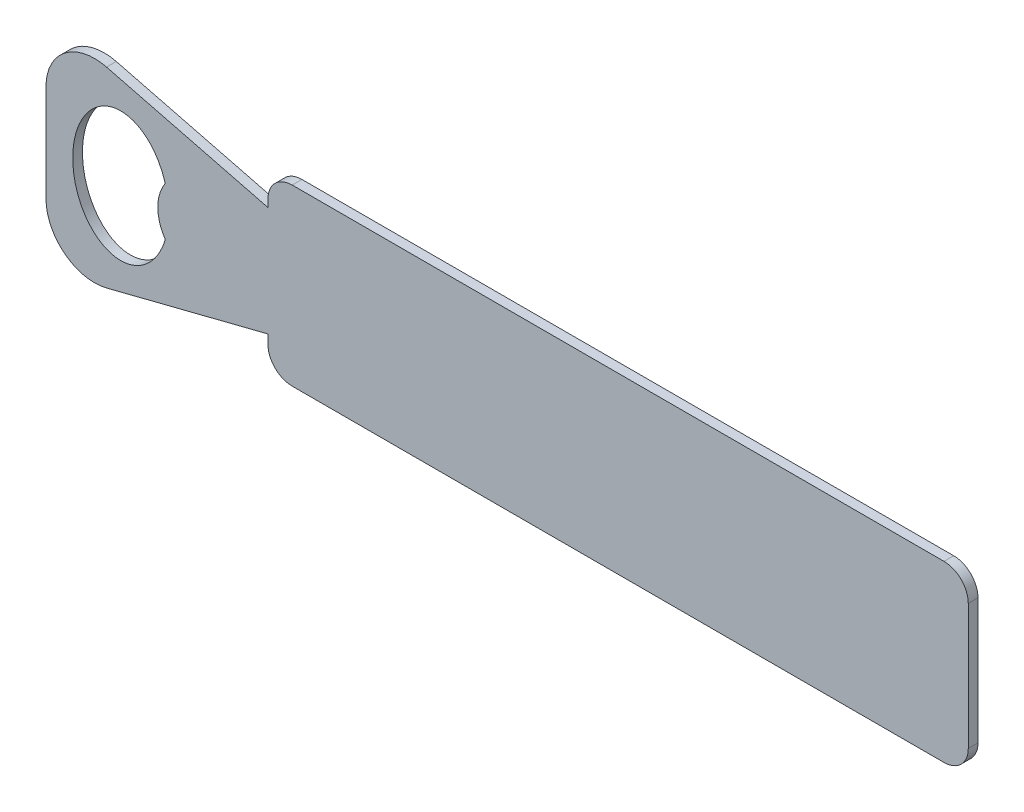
from build123d import *

# Parameters (mm, degrees)
EXTRUDE1_DEPTH     = 2
EXTRUDE2_DEPTH     = 2
SKETCH3_RX         = 13.343908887
SKETCH3_RY         = 9.885073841
CUT_EXTRUDE1_DEPTH = 99.043942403
SKETCH4_R          = 8.854172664
EXTRUDE3_DEPTH     = 2


with BuildPart() as part:
    # Sketch1 → Extrude1 (new body)
    with BuildSketch(Plane.XY):
        with BuildLine():
            Line((-45.254072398, 17.925423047), (88.905159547, 17.925423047))
            ThreePointArc((88.905159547, 17.925423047), (92.440693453, 16.460956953), (93.905159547, 12.925423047))
            Line((93.905159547, 12.925423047), (93.905159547, -12.925423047))
            ThreePointArc((93.905159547, -12.925423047), (92.440693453, -16.460956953), (88.905159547, -17.925423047))
            Line((88.905159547, -17.925423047), (-45.254072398, -17.925423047))
            ThreePointArc((-45.254072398, -17.925423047), (-48.789606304, -16.460956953), (-50.254072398, -12.925423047))
            Line((-50.254072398, -12.925423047), (-50.254072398, 12.925423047))
            ThreePointArc((-50.254072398, 12.925423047), (-48.789606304, 16.460956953), (-45.254072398, 17.925423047))
        make_face()
    extrude(amount=EXTRUDE1_DEPTH)

    # Sketch2 → Extrude2 (add, through all)
    with BuildSketch(Plane.XY):
        with BuildLine():
            Line((-5.799209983, 0.153345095), (-83.471778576, 19.846636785))
            ThreePointArc((-83.471778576, 19.846636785), (-92.070424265, 18.045639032), (-95.929439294, 10.153345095))
            Line((-95.929439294, 10.153345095), (-95.929439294, -9.846654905))
            ThreePointArc((-95.929439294, -9.846654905), (-92.070424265, -17.738948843), (-83.471778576, -19.539946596))
            Line((-83.471778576, -19.539946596), (-5.799209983, 0.153345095))
        make_face()
    extrude(amount=EXTRUDE2_DEPTH)

    # Sketch3 → Cut-Extrude1 (cut, through all)
    with BuildSketch(Plane.XY):
        with Locations(Location((-80.542335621, 0.153345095), (0, 0, 90))):
            Ellipse(SKETCH3_RX, SKETCH3_RY)
    extrude(amount=CUT_EXTRUDE1_DEPTH, mode=Mode.SUBTRACT)

    # Sketch4 → Extrude3 (add, through all)
    with BuildSketch(Plane.XY):
        with Locations((-64.064468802, 0.153345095)):
            Circle(SKETCH4_R)
    extrude(amount=EXTRUDE3_DEPTH)


solid = part.part
